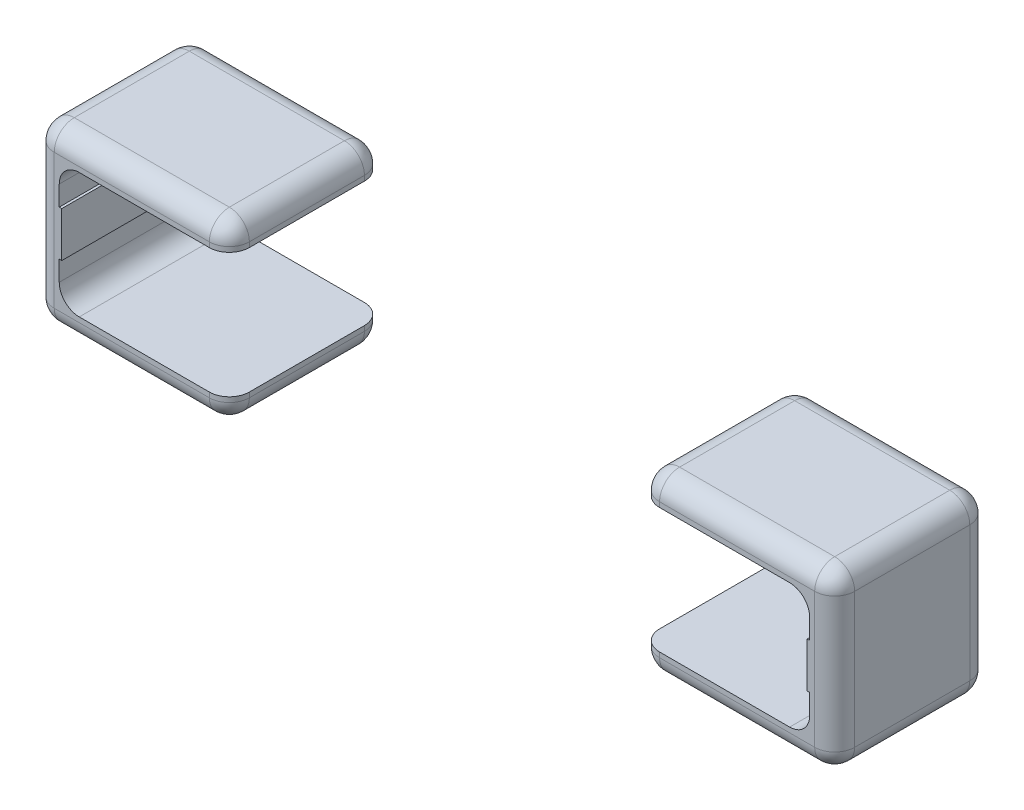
from build123d import *

# Parameters (mm, degrees)
LINEAR_AUSTRAGEN1_DEPTH         = 1.5
LINEAR_AUSTRAGEN1_DEPTH_BACK    = 15
SKIZZE1_W                       = 80
SKIZZE1_H                       = 17.5
SKIZZE2_W                       = 100
SKIZZE2_H                       = 37.5
SCHNITT_LINEAR_AUSTRAGEN1_DEPTH = 1
SCHNITT_LINEAR_AUSTRAGEN2_DEPTH = 15.5
VERRUNDUNG1_R                   = 2
SKIZZE5_W                       = 41
SKIZZE5_H                       = 37.457462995
SCHNITT_LINEAR_AUSTRAGEN3_DEPTH = 45.682211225
VERRUNDUNG2_R                   = 2
VERRUNDUNG3_R                   = 2


with BuildPart() as part:
    # Skizze1 → Linear austragen1 (new, two sides: drawn at the far end of the back side and taken through both)
    with BuildSketch(Plane.XY.offset(-LINEAR_AUSTRAGEN1_DEPTH_BACK)):
        with Locations((0, 3.75)):
            Rectangle(SKIZZE1_W, SKIZZE1_H)
    extrude(amount=LINEAR_AUSTRAGEN1_DEPTH + LINEAR_AUSTRAGEN1_DEPTH_BACK)

    # Skizze2 → Schnitt-Linear austragen1 (cut)
    with BuildSketch(Plane.XY.offset(1.5)):
        with Locations((0, 3.75)):
            Rectangle(SKIZZE2_W, SKIZZE2_H)
    extrude(amount=-SCHNITT_LINEAR_AUSTRAGEN1_DEPTH, mode=Mode.SUBTRACT)

    # Skizze4 → Schnitt-Linear austragen2 (cut)
    with BuildSketch(Plane.XY.offset(0.5)):
        with BuildLine():
            Line((-37.5, 6), (-37.5, 8))
            ThreePointArc((-37.5, 8), (-36.914213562, 9.414213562), (-35.5, 10))
            Line((-35.5, 10), (35.5, 10))
            ThreePointArc((35.5, 10), (36.914213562, 9.414213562), (37.5, 8))
            Line((37.5, 8), (37.5, 6))
            Line((37.5, 6), (37.25, 6))
            Line((37.25, 6), (37.25, 1.5))
            Line((37.25, 1.5), (37.5, 1.5))
            Line((37.5, 1.5), (37.5, -0.5))
            ThreePointArc((37.5, -0.5), (36.914213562, -1.914213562), (35.5, -2.5))
            Line((35.5, -2.5), (-35.5, -2.5))
            ThreePointArc((-35.5, -2.5), (-36.914213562, -1.914213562), (-37.5, -0.5))
            Line((-37.5, -0.5), (-37.5, 1.5))
            Line((-37.5, 1.5), (-37.25, 1.5))
            Line((-37.25, 1.5), (-37.25, 6))
            Line((-37.25, 6), (-37.5, 6))
        make_face()
    extrude(amount=-SCHNITT_LINEAR_AUSTRAGEN2_DEPTH, mode=Mode.SUBTRACT)

    # Verrundung1
    verrundung1_edges = [part.edges().sort_by_distance(p)[0] for p in [
        (0, 12.5, -15),
        (40, 3.75, -15),
        (0, -5, -15),
        (-40, 3.75, -15),
        (40, -5, -7.25),
        (40, 12.5, -7.25),
        (40, 3.75, 0.5),
        (-40, -5, -7.25),
        (-40, 12.5, -7.25),
        (0, 12.5, 0.5),
        (-40, 3.75, 0.5),
        (0, -5, 0.5),
    ]]
    fillet(verrundung1_edges, radius=VERRUNDUNG1_R)

    # Skizze5 → Schnitt-Linear austragen3 (cut, through all)
    with BuildSketch(Plane(origin=(0, 0, -15), x_dir=(-1, 0, 0), z_dir=(0, 0, -1))):
        with Locations((0, 6.12129664)):
            Rectangle(SKIZZE5_W, SKIZZE5_H)
    extrude(amount=-SCHNITT_LINEAR_AUSTRAGEN3_DEPTH, mode=Mode.SUBTRACT)


with BuildPart() as schnitt_linear_austragen3_piece_1:
    # of the separate pieces the step leaves, piece 1, a body of its own (schnitt_linear_austragen3_pieces)
    add(part.part.solids().sort_by_distance((38, -3, -15))[0])

    # Verrundung2
    verrundung2_edges = [schnitt_linear_austragen3_piece_1.edges().sort_by_distance(p)[0] for p in [
        (20.5, 12.5, -7.25),
        (20.5, -5, -7.25),
        (20.5, -2.75, 0.5),
        (20.5, 10.25, 0.5),
        (20.5, 11.914213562, -0.085786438),
        (20.5, 11.914213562, -14.414213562),
        (20.5, 10.25, -15),
        (20.5, -2.75, -15),
        (20.5, -4.414213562, -14.414213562),
        (20.5, -4.414213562, -0.085786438),
    ]]
    fillet(verrundung2_edges, radius=VERRUNDUNG2_R)


with BuildPart() as schnitt_linear_austragen3_piece_2:
    # of the separate pieces the step leaves, piece 2, a body of its own (schnitt_linear_austragen3_pieces)
    add(part.part.solids().sort_by_distance((-40, 10.5, -13))[0])

    # Verrundung3
    verrundung3_edges = [schnitt_linear_austragen3_piece_2.edges().sort_by_distance(p)[0] for p in [
        (-20.5, 11.914213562, -0.085786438),
        (-20.5, 10.25, -15),
        (-20.5, -2.75, -15),
        (-20.5, 10.25, 0.5),
        (-20.5, 12.5, -7.25),
        (-20.5, -2.75, 0.5),
        (-20.5, -5, -7.25),
        (-20.5, -4.414213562, -14.414213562),
        (-20.5, -4.414213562, -0.085786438),
        (-20.5, 11.914213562, -14.414213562),
    ]]
    fillet(verrundung3_edges, radius=VERRUNDUNG3_R)


solid = Compound([schnitt_linear_austragen3_piece_1.part, schnitt_linear_austragen3_piece_2.part])
